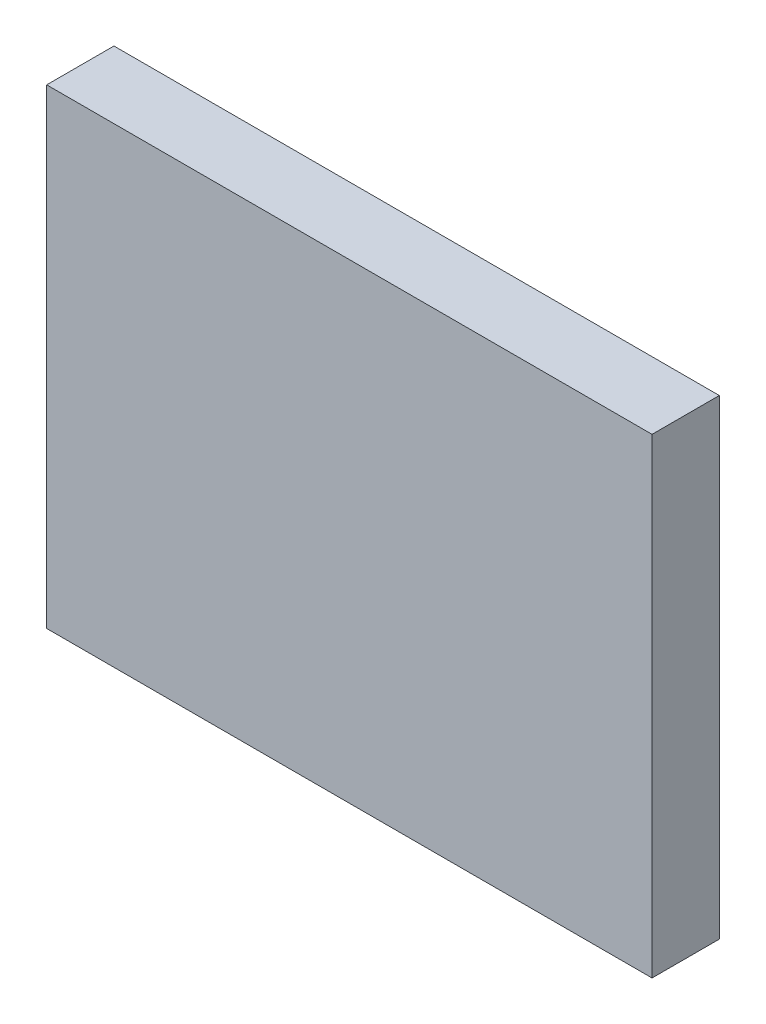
ISO-10303-21;
HEADER;
FILE_DESCRIPTION(('STEP AP214'),'2;1');
FILE_NAME('part.step','',(''),(''),'','','');
FILE_SCHEMA(('AUTOMOTIVE_DESIGN { 1 0 10303 214 1 1 1 1 }'));
ENDSEC;
DATA;
#1=APPLICATION_CONTEXT('core data for automotive mechanical design processes');
#2=APPLICATION_PROTOCOL_DEFINITION('international standard','automotive_design',2000,#1);
#3=PRODUCT_CONTEXT('',#1,'mechanical');
#4=PRODUCT('Part','Part','',(#3));
#5=PRODUCT_RELATED_PRODUCT_CATEGORY('part','',(#4));
#6=PRODUCT_DEFINITION_FORMATION('','',#4);
#7=PRODUCT_DEFINITION_CONTEXT('part definition',#1,'design');
#8=PRODUCT_DEFINITION('design','',#6,#7);
#9=PRODUCT_DEFINITION_SHAPE('','',#8);
#10=(LENGTH_UNIT() NAMED_UNIT(*) SI_UNIT(.MILLI.,.METRE.));
#11=(NAMED_UNIT(*) PLANE_ANGLE_UNIT() SI_UNIT($,.RADIAN.));
#12=(NAMED_UNIT(*) SI_UNIT($,.STERADIAN.) SOLID_ANGLE_UNIT());
#13=UNCERTAINTY_MEASURE_WITH_UNIT(LENGTH_MEASURE(1.E-05),#10,'distance_accuracy_value','');
#14=(GEOMETRIC_REPRESENTATION_CONTEXT(3) GLOBAL_UNCERTAINTY_ASSIGNED_CONTEXT((#13)) GLOBAL_UNIT_ASSIGNED_CONTEXT((#10,
#11,#12)) REPRESENTATION_CONTEXT('',''));
#15=CARTESIAN_POINT('',(0.,0.,0.));
#16=DIRECTION('',(0.,0.,1.));
#17=DIRECTION('',(1.,0.,0.));
#18=AXIS2_PLACEMENT_3D('',#15,#16,#17);
#19=CARTESIAN_POINT('',(-127.,-101.6,0.));
#20=DIRECTION('',(0.,0.,1.));
#21=DIRECTION('',(1.,0.,0.));
#22=AXIS2_PLACEMENT_3D('',#19,#20,#21);
#23=PLANE('',#22);
#24=DIRECTION('',(-1.,0.,0.));
#25=VECTOR('',#24,1.);
#26=CARTESIAN_POINT('',(114.3,88.9,0.));
#27=LINE('',#26,#25);
#28=CARTESIAN_POINT('',(114.3,88.9,0.));
#29=VERTEX_POINT('',#28);
#30=CARTESIAN_POINT('',(-114.3,88.9,0.));
#31=VERTEX_POINT('',#30);
#32=EDGE_CURVE('E77',#29,#31,#27,.T.);
#33=ORIENTED_EDGE('',*,*,#32,.T.);
#34=DIRECTION('',(0.,-1.,0.));
#35=VECTOR('',#34,1.);
#36=CARTESIAN_POINT('',(-114.3,88.9,0.));
#37=LINE('',#36,#35);
#38=CARTESIAN_POINT('',(-114.3,-88.9,0.));
#39=VERTEX_POINT('',#38);
#40=EDGE_CURVE('E92',#31,#39,#37,.T.);
#41=ORIENTED_EDGE('',*,*,#40,.T.);
#42=DIRECTION('',(1.,0.,0.));
#43=VECTOR('',#42,1.);
#44=CARTESIAN_POINT('',(-114.3,-88.9,0.));
#45=LINE('',#44,#43);
#46=CARTESIAN_POINT('',(114.3,-88.9,0.));
#47=VERTEX_POINT('',#46);
#48=EDGE_CURVE('E95',#39,#47,#45,.T.);
#49=ORIENTED_EDGE('',*,*,#48,.T.);
#50=DIRECTION('',(0.,1.,0.));
#51=VECTOR('',#50,1.);
#52=CARTESIAN_POINT('',(114.3,-88.9,0.));
#53=LINE('',#52,#51);
#54=EDGE_CURVE('E55',#47,#29,#53,.T.);
#55=ORIENTED_EDGE('',*,*,#54,.T.);
#56=EDGE_LOOP('',(#33,#41,#49,#55));
#57=FACE_BOUND('',#56,.T.);
#58=ADVANCED_FACE('F31',(#57),#23,.T.);
#59=CARTESIAN_POINT('',(-114.3,88.9,-25.4));
#60=DIRECTION('',(-1.,0.,0.));
#61=DIRECTION('',(0.,-1.,0.));
#62=AXIS2_PLACEMENT_3D('',#59,#60,#61);
#63=PLANE('',#62);
#64=ORIENTED_EDGE('',*,*,#40,.F.);
#65=DIRECTION('',(0.,0.,1.));
#66=VECTOR('',#65,1.);
#67=CARTESIAN_POINT('',(-114.3,88.9,-25.4));
#68=LINE('',#67,#66);
#69=CARTESIAN_POINT('',(-114.3,88.9,-25.4));
#70=VERTEX_POINT('',#69);
#71=EDGE_CURVE('E11',#70,#31,#68,.T.);
#72=ORIENTED_EDGE('',*,*,#71,.F.);
#73=DIRECTION('',(0.,-1.,0.));
#74=VECTOR('',#73,1.);
#75=CARTESIAN_POINT('',(-114.3,88.9,-25.4));
#76=LINE('',#75,#74);
#77=CARTESIAN_POINT('',(-114.3,-88.9,-25.4));
#78=VERTEX_POINT('',#77);
#79=EDGE_CURVE('E47',#70,#78,#76,.T.);
#80=ORIENTED_EDGE('',*,*,#79,.T.);
#81=DIRECTION('',(0.,0.,1.));
#82=VECTOR('',#81,1.);
#83=CARTESIAN_POINT('',(-114.3,-88.9,-25.4));
#84=LINE('',#83,#82);
#85=EDGE_CURVE('E34',#78,#39,#84,.T.);
#86=ORIENTED_EDGE('',*,*,#85,.T.);
#87=EDGE_LOOP('',(#64,#72,#80,#86));
#88=FACE_BOUND('',#87,.T.);
#89=ADVANCED_FACE('F104',(#88),#63,.T.);
#90=CARTESIAN_POINT('',(114.3,88.9,-25.4));
#91=DIRECTION('',(0.,1.,0.));
#92=DIRECTION('',(0.,0.,1.));
#93=AXIS2_PLACEMENT_3D('',#90,#91,#92);
#94=PLANE('',#93);
#95=ORIENTED_EDGE('',*,*,#32,.F.);
#96=DIRECTION('',(0.,0.,1.));
#97=VECTOR('',#96,1.);
#98=CARTESIAN_POINT('',(114.3,88.9,-25.4));
#99=LINE('',#98,#97);
#100=CARTESIAN_POINT('',(114.3,88.9,-25.4));
#101=VERTEX_POINT('',#100);
#102=EDGE_CURVE('E39',#101,#29,#99,.T.);
#103=ORIENTED_EDGE('',*,*,#102,.F.);
#104=DIRECTION('',(-1.,0.,0.));
#105=VECTOR('',#104,1.);
#106=CARTESIAN_POINT('',(114.3,88.9,-25.4));
#107=LINE('',#106,#105);
#108=EDGE_CURVE('E75',#101,#70,#107,.T.);
#109=ORIENTED_EDGE('',*,*,#108,.T.);
#110=ORIENTED_EDGE('',*,*,#71,.T.);
#111=EDGE_LOOP('',(#95,#103,#109,#110));
#112=FACE_BOUND('',#111,.T.);
#113=ADVANCED_FACE('F73',(#112),#94,.T.);
#114=CARTESIAN_POINT('',(114.3,-88.9,-25.4));
#115=DIRECTION('',(1.,0.,0.));
#116=DIRECTION('',(0.,1.,0.));
#117=AXIS2_PLACEMENT_3D('',#114,#115,#116);
#118=PLANE('',#117);
#119=ORIENTED_EDGE('',*,*,#54,.F.);
#120=DIRECTION('',(0.,0.,1.));
#121=VECTOR('',#120,1.);
#122=CARTESIAN_POINT('',(114.3,-88.9,-25.4));
#123=LINE('',#122,#121);
#124=CARTESIAN_POINT('',(114.3,-88.9,-25.4));
#125=VERTEX_POINT('',#124);
#126=EDGE_CURVE('E78',#125,#47,#123,.T.);
#127=ORIENTED_EDGE('',*,*,#126,.F.);
#128=DIRECTION('',(0.,1.,0.));
#129=VECTOR('',#128,1.);
#130=CARTESIAN_POINT('',(114.3,-88.9,-25.4));
#131=LINE('',#130,#129);
#132=EDGE_CURVE('E81',#125,#101,#131,.T.);
#133=ORIENTED_EDGE('',*,*,#132,.T.);
#134=ORIENTED_EDGE('',*,*,#102,.T.);
#135=EDGE_LOOP('',(#119,#127,#133,#134));
#136=FACE_BOUND('',#135,.T.);
#137=ADVANCED_FACE('F82',(#136),#118,.T.);
#138=CARTESIAN_POINT('',(-114.3,-88.9,-25.4));
#139=DIRECTION('',(0.,-1.,0.));
#140=DIRECTION('',(0.,0.,-1.));
#141=AXIS2_PLACEMENT_3D('',#138,#139,#140);
#142=PLANE('',#141);
#143=ORIENTED_EDGE('',*,*,#48,.F.);
#144=ORIENTED_EDGE('',*,*,#85,.F.);
#145=DIRECTION('',(1.,0.,0.));
#146=VECTOR('',#145,1.);
#147=CARTESIAN_POINT('',(-114.3,-88.9,-25.4));
#148=LINE('',#147,#146);
#149=EDGE_CURVE('E86',#78,#125,#148,.T.);
#150=ORIENTED_EDGE('',*,*,#149,.T.);
#151=ORIENTED_EDGE('',*,*,#126,.T.);
#152=EDGE_LOOP('',(#143,#144,#150,#151));
#153=FACE_BOUND('',#152,.T.);
#154=ADVANCED_FACE('F101',(#153),#142,.T.);
#155=CARTESIAN_POINT('',(-127.,-101.6,-25.4));
#156=DIRECTION('',(0.,0.,1.));
#157=DIRECTION('',(1.,0.,0.));
#158=AXIS2_PLACEMENT_3D('',#155,#156,#157);
#159=PLANE('',#158);
#160=ORIENTED_EDGE('',*,*,#79,.F.);
#161=ORIENTED_EDGE('',*,*,#108,.F.);
#162=ORIENTED_EDGE('',*,*,#132,.F.);
#163=ORIENTED_EDGE('',*,*,#149,.F.);
#164=EDGE_LOOP('',(#160,#161,#162,#163));
#165=FACE_BOUND('',#164,.T.);
#166=ADVANCED_FACE('F88',(#165),#159,.F.);
#167=CLOSED_SHELL('',(#58,#89,#113,#137,#154,#166));
#168=MANIFOLD_SOLID_BREP('B2',#167);
#169=ADVANCED_BREP_SHAPE_REPRESENTATION('',(#18,#168),#14);
#170=SHAPE_DEFINITION_REPRESENTATION(#9,#169);
ENDSEC;
END-ISO-10303-21;
